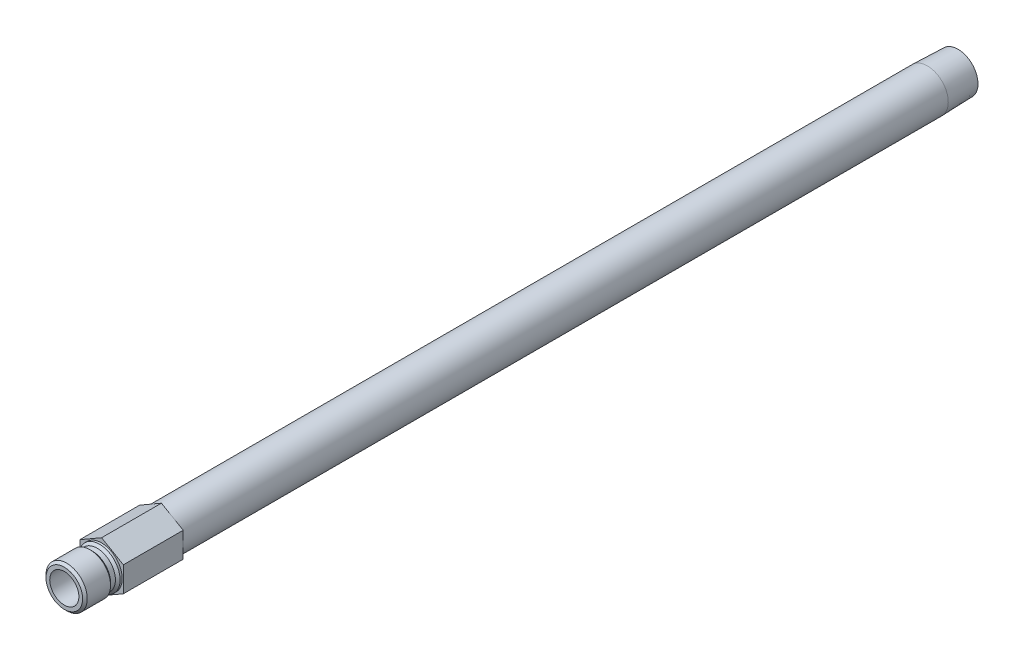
from build123d import *

# Parameters (mm, degrees)
SKETCH2_R           = 4.6228
BOSS_EXTRUDE1_DEPTH = 19.558


with BuildPart() as part:
    # Sketch1 → Revolve1 (revolve)
    with BuildSketch(Plane(origin=(0, 0, 0), x_dir=(0, 0, -1), z_dir=(1, 0, 0))):
        Polygon((-12.192, 4.7625), (-12.192, 5.9817), (-11.43, 6.7437), (-3.81, 6.7437), (-3.048, 5.9817), (-1.4605, 5.9817), (-0.6985, 6.7437), (0, 6.7437), (0, 6.858), (269.875, 6.858), (279.908, 6.544470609), (279.908, 4.6228), (0.074279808, 4.6228), (0, 4.7625), align=None)
    revolve(axis=Axis((0, 0, 0), (0, 0, 1)))

    # Sketch2 → Boss-Extrude1 (add)
    with BuildSketch(Plane.XY):
        Polygon((-7.112, 4.106115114), (-7.112, -4.106115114), (0, -8.212230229), (7.112, -4.106115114), (7.112, 4.106115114), (0, 8.212230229), align=None)
        with Locations(Location((0, 0, 0), (0, 0, 90))):
            Circle(SKETCH2_R, mode=Mode.SUBTRACT)
    extrude(amount=-BOSS_EXTRUDE1_DEPTH)


solid = part.part
